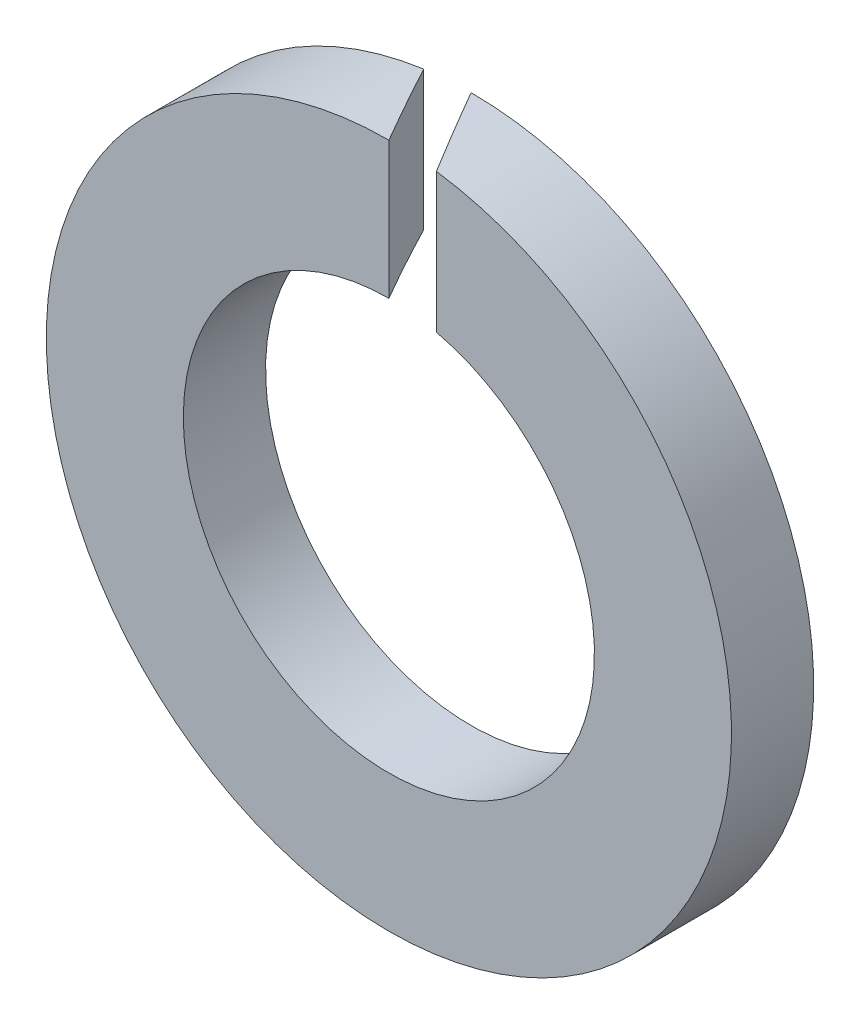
ISO-10303-21;
HEADER;
FILE_DESCRIPTION(('STEP AP214'),'2;1');
FILE_NAME('part.step','',(''),(''),'','','');
FILE_SCHEMA(('AUTOMOTIVE_DESIGN { 1 0 10303 214 1 1 1 1 }'));
ENDSEC;
DATA;
#1=APPLICATION_CONTEXT('core data for automotive mechanical design processes');
#2=APPLICATION_PROTOCOL_DEFINITION('international standard','automotive_design',2000,#1);
#3=PRODUCT_CONTEXT('',#1,'mechanical');
#4=PRODUCT('Part','Part','',(#3));
#5=PRODUCT_RELATED_PRODUCT_CATEGORY('part','',(#4));
#6=PRODUCT_DEFINITION_FORMATION('','',#4);
#7=PRODUCT_DEFINITION_CONTEXT('part definition',#1,'design');
#8=PRODUCT_DEFINITION('design','',#6,#7);
#9=PRODUCT_DEFINITION_SHAPE('','',#8);
#10=(LENGTH_UNIT() NAMED_UNIT(*) SI_UNIT(.MILLI.,.METRE.));
#11=(NAMED_UNIT(*) PLANE_ANGLE_UNIT() SI_UNIT($,.RADIAN.));
#12=(NAMED_UNIT(*) SI_UNIT($,.STERADIAN.) SOLID_ANGLE_UNIT());
#13=UNCERTAINTY_MEASURE_WITH_UNIT(LENGTH_MEASURE(1.E-05),#10,'distance_accuracy_value','');
#14=(GEOMETRIC_REPRESENTATION_CONTEXT(3) GLOBAL_UNCERTAINTY_ASSIGNED_CONTEXT((#13)) GLOBAL_UNIT_ASSIGNED_CONTEXT((#10,
#11,#12)) REPRESENTATION_CONTEXT('',''));
#15=CARTESIAN_POINT('',(0.,0.,0.));
#16=DIRECTION('',(0.,0.,1.));
#17=DIRECTION('',(1.,0.,0.));
#18=AXIS2_PLACEMENT_3D('',#15,#16,#17);
#19=CARTESIAN_POINT('',(0.,0.,-0.6));
#20=DIRECTION('',(0.,0.,1.));
#21=DIRECTION('',(1.,0.,0.));
#22=AXIS2_PLACEMENT_3D('',#19,#20,#21);
#23=CYLINDRICAL_SURFACE('',#22,2.5);
#24=CARTESIAN_POINT('',(0.,0.,0.));
#25=DIRECTION('',(0.,0.,1.));
#26=DIRECTION('',(1.,0.,0.));
#27=AXIS2_PLACEMENT_3D('',#24,#25,#26);
#28=CIRCLE('',#27,2.5);
#29=CARTESIAN_POINT('',(0.,2.5,0.));
#30=VERTEX_POINT('',#29);
#31=CARTESIAN_POINT('',(0.346410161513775,2.47588368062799,0.));
#32=VERTEX_POINT('',#31);
#33=EDGE_CURVE('E86',#30,#32,#28,.T.);
#34=ORIENTED_EDGE('',*,*,#33,.F.);
#35=CARTESIAN_POINT('',(0.,0.,0.));
#36=DIRECTION('',(0.866025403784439,0.,-0.5));
#37=DIRECTION('',(0.5,0.,0.866025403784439));
#38=AXIS2_PLACEMENT_3D('',#35,#36,#37);
#39=ELLIPSE('',#38,5.,2.5);
#40=CARTESIAN_POINT('',(-0.346410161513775,2.47588368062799,-0.6));
#41=VERTEX_POINT('',#40);
#42=EDGE_CURVE('E70',#30,#41,#39,.F.);
#43=ORIENTED_EDGE('',*,*,#42,.T.);
#44=CARTESIAN_POINT('',(0.,0.,-0.6));
#45=DIRECTION('',(0.,0.,1.));
#46=DIRECTION('',(1.,0.,0.));
#47=AXIS2_PLACEMENT_3D('',#44,#45,#46);
#48=CIRCLE('',#47,2.5);
#49=CARTESIAN_POINT('',(0.,2.5,-0.6));
#50=VERTEX_POINT('',#49);
#51=EDGE_CURVE('E91',#41,#50,#48,.T.);
#52=ORIENTED_EDGE('',*,*,#51,.T.);
#53=CARTESIAN_POINT('',(0.,0.,-0.6));
#54=DIRECTION('',(-0.866025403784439,0.,0.5));
#55=DIRECTION('',(0.5,0.,0.866025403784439));
#56=AXIS2_PLACEMENT_3D('',#53,#54,#55);
#57=ELLIPSE('',#56,5.,2.5);
#58=EDGE_CURVE('E79',#50,#32,#57,.F.);
#59=ORIENTED_EDGE('',*,*,#58,.T.);
#60=EDGE_LOOP('',(#34,#43,#52,#59));
#61=FACE_BOUND('',#60,.T.);
#62=ADVANCED_FACE('F33',(#61),#23,.T.);
#63=CARTESIAN_POINT('',(0.,0.,-0.6));
#64=DIRECTION('',(0.,0.,1.));
#65=DIRECTION('',(1.,0.,0.));
#66=AXIS2_PLACEMENT_3D('',#63,#64,#65);
#67=PLANE('',#66);
#68=DIRECTION('',(0.,-1.,0.));
#69=VECTOR('',#68,1.);
#70=CARTESIAN_POINT('',(-0.346410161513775,2.5,-0.6));
#71=LINE('',#70,#69);
#72=CARTESIAN_POINT('',(-0.346410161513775,1.45945195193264,-0.6));
#73=VERTEX_POINT('',#72);
#74=EDGE_CURVE('E73',#41,#73,#71,.T.);
#75=ORIENTED_EDGE('',*,*,#74,.T.);
#76=CARTESIAN_POINT('',(0.,0.,-0.6));
#77=DIRECTION('',(0.,0.,1.));
#78=DIRECTION('',(1.,0.,0.));
#79=AXIS2_PLACEMENT_3D('',#76,#77,#78);
#80=CIRCLE('',#79,1.5);
#81=CARTESIAN_POINT('',(0.,1.5,-0.6));
#82=VERTEX_POINT('',#81);
#83=EDGE_CURVE('E92',#73,#82,#80,.T.);
#84=ORIENTED_EDGE('',*,*,#83,.T.);
#85=DIRECTION('',(0.,-1.,0.));
#86=VECTOR('',#85,1.);
#87=CARTESIAN_POINT('',(0.,2.5,-0.6));
#88=LINE('',#87,#86);
#89=EDGE_CURVE('E54',#50,#82,#88,.T.);
#90=ORIENTED_EDGE('',*,*,#89,.F.);
#91=ORIENTED_EDGE('',*,*,#51,.F.);
#92=EDGE_LOOP('',(#75,#84,#90,#91));
#93=FACE_BOUND('',#92,.T.);
#94=ADVANCED_FACE('F107',(#93),#67,.F.);
#95=CARTESIAN_POINT('',(0.,0.,0.));
#96=DIRECTION('',(0.,0.,1.));
#97=DIRECTION('',(1.,0.,0.));
#98=AXIS2_PLACEMENT_3D('',#95,#96,#97);
#99=PLANE('',#98);
#100=CARTESIAN_POINT('',(0.,0.,0.));
#101=DIRECTION('',(0.,0.,1.));
#102=DIRECTION('',(1.,0.,0.));
#103=AXIS2_PLACEMENT_3D('',#100,#101,#102);
#104=CIRCLE('',#103,1.5);
#105=CARTESIAN_POINT('',(0.,1.5,0.));
#106=VERTEX_POINT('',#105);
#107=CARTESIAN_POINT('',(0.346410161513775,1.45945195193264,0.));
#108=VERTEX_POINT('',#107);
#109=EDGE_CURVE('E78',#106,#108,#104,.T.);
#110=ORIENTED_EDGE('',*,*,#109,.F.);
#111=DIRECTION('',(0.,-1.,0.));
#112=VECTOR('',#111,1.);
#113=CARTESIAN_POINT('',(0.,2.5,0.));
#114=LINE('',#113,#112);
#115=EDGE_CURVE('E46',#30,#106,#114,.T.);
#116=ORIENTED_EDGE('',*,*,#115,.F.);
#117=ORIENTED_EDGE('',*,*,#33,.T.);
#118=DIRECTION('',(0.,-1.,0.));
#119=VECTOR('',#118,1.);
#120=CARTESIAN_POINT('',(0.346410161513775,2.5,0.));
#121=LINE('',#120,#119);
#122=EDGE_CURVE('E88',#32,#108,#121,.T.);
#123=ORIENTED_EDGE('',*,*,#122,.T.);
#124=EDGE_LOOP('',(#110,#116,#117,#123));
#125=FACE_BOUND('',#124,.T.);
#126=ADVANCED_FACE('F84',(#125),#99,.T.);
#127=CARTESIAN_POINT('',(0.,0.,-0.6));
#128=DIRECTION('',(0.,0.,1.));
#129=DIRECTION('',(1.,0.,0.));
#130=AXIS2_PLACEMENT_3D('',#127,#128,#129);
#131=CYLINDRICAL_SURFACE('',#130,1.5);
#132=CARTESIAN_POINT('',(0.,0.,0.));
#133=DIRECTION('',(0.866025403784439,0.,-0.5));
#134=DIRECTION('',(0.5,0.,0.866025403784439));
#135=AXIS2_PLACEMENT_3D('',#132,#133,#134);
#136=ELLIPSE('',#135,3.,1.5);
#137=EDGE_CURVE('E11',#106,#73,#136,.F.);
#138=ORIENTED_EDGE('',*,*,#137,.F.);
#139=ORIENTED_EDGE('',*,*,#109,.T.);
#140=CARTESIAN_POINT('',(0.,0.,-0.6));
#141=DIRECTION('',(-0.866025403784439,0.,0.5));
#142=DIRECTION('',(0.5,0.,0.866025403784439));
#143=AXIS2_PLACEMENT_3D('',#140,#141,#142);
#144=ELLIPSE('',#143,3.,1.5);
#145=EDGE_CURVE('E40',#82,#108,#144,.F.);
#146=ORIENTED_EDGE('',*,*,#145,.F.);
#147=ORIENTED_EDGE('',*,*,#83,.F.);
#148=EDGE_LOOP('',(#138,#139,#146,#147));
#149=FACE_BOUND('',#148,.T.);
#150=ADVANCED_FACE('F102',(#149),#131,.F.);
#151=CARTESIAN_POINT('',(0.,2.5,-0.6));
#152=DIRECTION('',(-0.866025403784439,0.,0.5));
#153=DIRECTION('',(0.5,0.,0.866025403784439));
#154=AXIS2_PLACEMENT_3D('',#151,#152,#153);
#155=PLANE('',#154);
#156=ORIENTED_EDGE('',*,*,#89,.T.);
#157=ORIENTED_EDGE('',*,*,#145,.T.);
#158=ORIENTED_EDGE('',*,*,#122,.F.);
#159=ORIENTED_EDGE('',*,*,#58,.F.);
#160=EDGE_LOOP('',(#156,#157,#158,#159));
#161=FACE_BOUND('',#160,.T.);
#162=ADVANCED_FACE('F98',(#161),#155,.T.);
#163=CARTESIAN_POINT('',(0.,2.5,0.));
#164=DIRECTION('',(0.866025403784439,0.,-0.5));
#165=DIRECTION('',(-0.5,0.,-0.866025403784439));
#166=AXIS2_PLACEMENT_3D('',#163,#164,#165);
#167=PLANE('',#166);
#168=ORIENTED_EDGE('',*,*,#115,.T.);
#169=ORIENTED_EDGE('',*,*,#137,.T.);
#170=ORIENTED_EDGE('',*,*,#74,.F.);
#171=ORIENTED_EDGE('',*,*,#42,.F.);
#172=EDGE_LOOP('',(#168,#169,#170,#171));
#173=FACE_BOUND('',#172,.T.);
#174=ADVANCED_FACE('F71',(#173),#167,.T.);
#175=CLOSED_SHELL('',(#62,#94,#126,#150,#162,#174));
#176=MANIFOLD_SOLID_BREP('B2',#175);
#177=ADVANCED_BREP_SHAPE_REPRESENTATION('',(#18,#176),#14);
#178=SHAPE_DEFINITION_REPRESENTATION(#9,#177);
ENDSEC;
END-ISO-10303-21;
